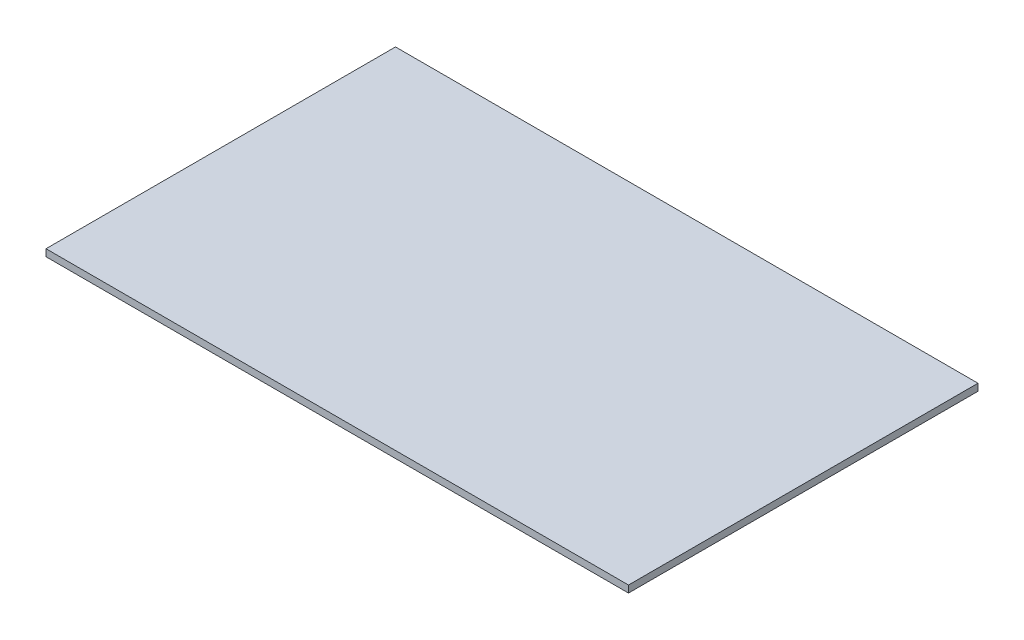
from build123d import *

# Parameters (mm, degrees)
SKETCH1_W           = 1524
SKETCH1_H           = 914.4
BOSS_EXTRUDE1_DEPTH = 18.25625


with BuildPart() as part:
    # Sketch1 → Boss-Extrude1 (new body)
    with BuildSketch(Plane(origin=(0, 0, 0), x_dir=(1, 0, 0), z_dir=(0, 1, 0))):
        Rectangle(SKETCH1_W, SKETCH1_H)
    extrude(amount=BOSS_EXTRUDE1_DEPTH)


solid = part.part
